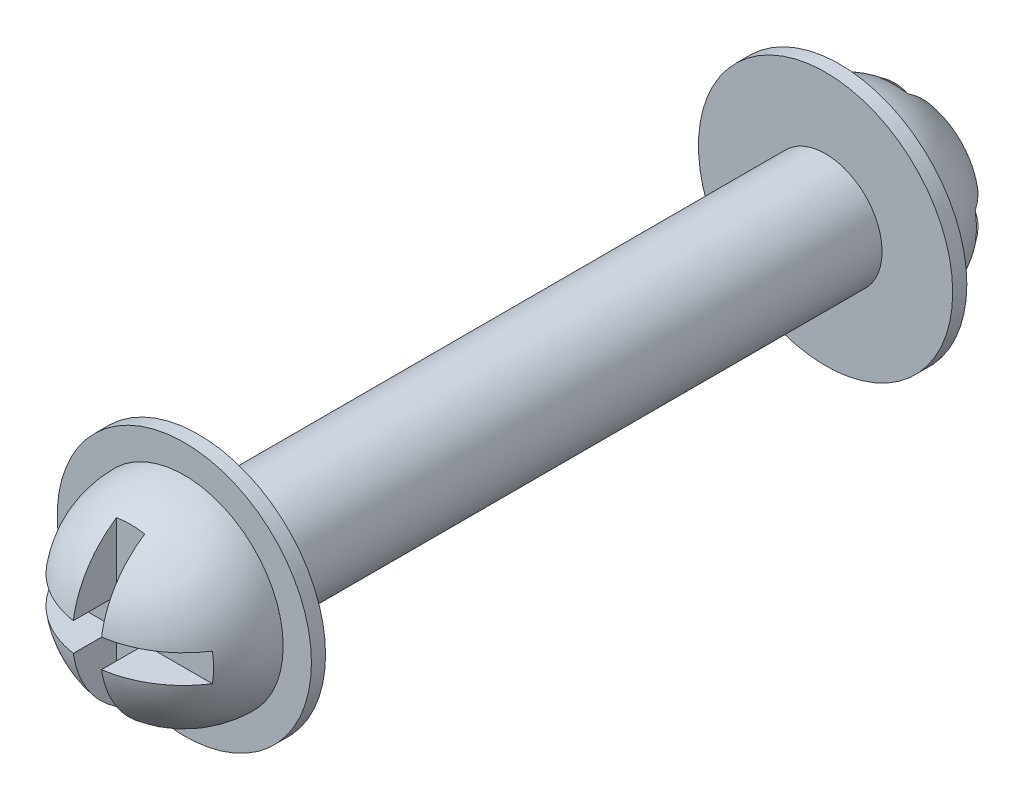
from build123d import *

# Parameters (mm, degrees)
CUT_EXTRUDE1_DEPTH      = 53.026422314
CUT_EXTRUDE1_DEPTH_BACK = 53.026422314
SKETCH2_W               = 6.35
SKETCH2_H               = 3.175
CUT_EXTRUDE2_DEPTH      = 52.949632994
CUT_EXTRUDE2_DEPTH_BACK = 52.949632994
SKETCH3_W               = 7.62
SKETCH3_H               = 3.175


with BuildPart() as part:
    # Sketch1 → Revolve1 (revolve)
    with BuildSketch(Plane(origin=(0, 0, 0), x_dir=(0, 0, -1), z_dir=(1, 0, 0)), mode=Mode.PRIVATE) as revolve1_sk:
        with BuildLine():
            Line((-35.2425, 6.35), (-35.2425, 14.2875))
            Line((-35.2425, 14.2875), (-36.83, 14.2875))
            Line((-36.83, 14.2875), (-36.83, 11.1125))
            ThreePointArc((-36.83, 11.1125), (-44.687724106, 7.857724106), (-47.9425, 0))
            Line((-47.9425, 0), (47.9425, 0))
            ThreePointArc((47.9425, 0), (44.687724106, 7.857724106), (36.83, 11.1125))
            Line((36.83, 11.1125), (36.83, 14.2875))
            Line((36.83, 14.2875), (35.2425, 14.2875))
            Line((35.2425, 14.2875), (35.2425, 6.35))
            Line((35.2425, 6.35), (-35.2425, 6.35))
        make_face()
    revolve(revolve1_sk.sketch.rotate(Axis((0, 0, 77.178613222), (0, 0, -1)), 90), axis=Axis((0, 0, 77.178613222), (0, 0, -1)))

    # Sketch2 → Cut-Extrude1 (cut, two sides: drawn at the far end of the back side and taken through both)
    with BuildSketch(Plane(origin=(0, 0, 0), x_dir=(0, 0, -1), z_dir=(1, 0, 0)).offset(-CUT_EXTRUDE1_DEPTH_BACK)):
        with Locations((-46.0375, 0)):
            Rectangle(SKETCH2_W, SKETCH2_H)
        with Locations((46.0375, 0)):
            Rectangle(SKETCH2_W, SKETCH2_H)
    extrude(amount=CUT_EXTRUDE1_DEPTH + CUT_EXTRUDE1_DEPTH_BACK, mode=Mode.SUBTRACT)

    # Sketch3 → Cut-Extrude2 (cut, two sides: drawn at the far end of the back side and taken through both)
    with BuildSketch(Plane(origin=(0.05268303, 0, -0.014876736), x_dir=(0, 0, -1), z_dir=(0, 1, 0)).offset(-CUT_EXTRUDE2_DEPTH_BACK)):
        with Locations((-46.687376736, 0.05268303)):
            Rectangle(SKETCH3_W, SKETCH3_H)
        with Locations((46.657623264, 0.05268303)):
            Rectangle(SKETCH3_W, SKETCH3_H)
    extrude(amount=CUT_EXTRUDE2_DEPTH + CUT_EXTRUDE2_DEPTH_BACK, mode=Mode.SUBTRACT)


solid = part.part
